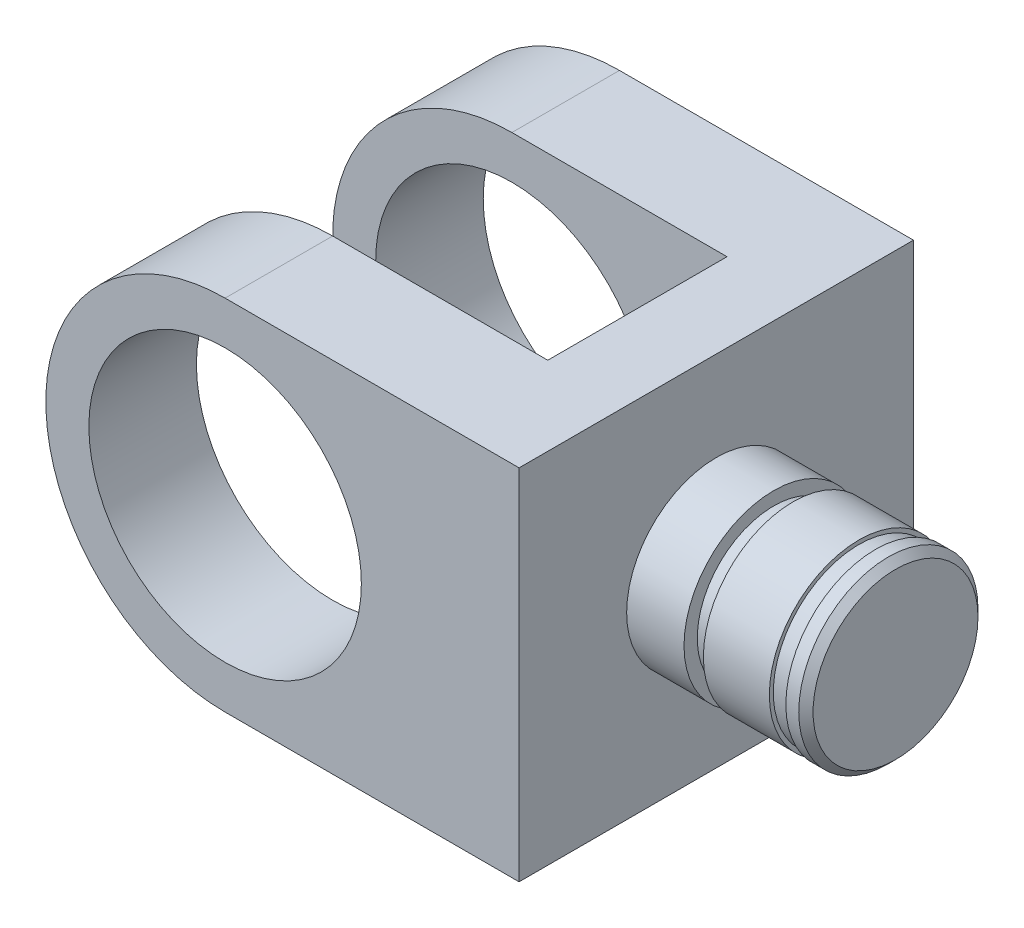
ISO-10303-21;
HEADER;
FILE_DESCRIPTION(('STEP AP214'),'2;1');
FILE_NAME('part.step','',(''),(''),'','','');
FILE_SCHEMA(('AUTOMOTIVE_DESIGN { 1 0 10303 214 1 1 1 1 }'));
ENDSEC;
DATA;
#1=APPLICATION_CONTEXT('core data for automotive mechanical design processes');
#2=APPLICATION_PROTOCOL_DEFINITION('international standard','automotive_design',2000,#1);
#3=PRODUCT_CONTEXT('',#1,'mechanical');
#4=PRODUCT('Part','Part','',(#3));
#5=PRODUCT_RELATED_PRODUCT_CATEGORY('part','',(#4));
#6=PRODUCT_DEFINITION_FORMATION('','',#4);
#7=PRODUCT_DEFINITION_CONTEXT('part definition',#1,'design');
#8=PRODUCT_DEFINITION('design','',#6,#7);
#9=PRODUCT_DEFINITION_SHAPE('','',#8);
#10=(LENGTH_UNIT() NAMED_UNIT(*) SI_UNIT(.MILLI.,.METRE.));
#11=(NAMED_UNIT(*) PLANE_ANGLE_UNIT() SI_UNIT($,.RADIAN.));
#12=(NAMED_UNIT(*) SI_UNIT($,.STERADIAN.) SOLID_ANGLE_UNIT());
#13=UNCERTAINTY_MEASURE_WITH_UNIT(LENGTH_MEASURE(1.E-05),#10,'distance_accuracy_value','');
#14=(GEOMETRIC_REPRESENTATION_CONTEXT(3) GLOBAL_UNCERTAINTY_ASSIGNED_CONTEXT((#13)) GLOBAL_UNIT_ASSIGNED_CONTEXT((#10,
#11,#12)) REPRESENTATION_CONTEXT('',''));
#15=CARTESIAN_POINT('',(0.,0.,0.));
#16=DIRECTION('',(0.,0.,1.));
#17=DIRECTION('',(1.,0.,0.));
#18=AXIS2_PLACEMENT_3D('',#15,#16,#17);
#19=CARTESIAN_POINT('',(-56.3524439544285,35.3069949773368,27.5));
#20=DIRECTION('',(0.,-1.,0.));
#21=DIRECTION('',(0.,0.,-1.));
#22=AXIS2_PLACEMENT_3D('',#19,#20,#21);
#23=PLANE('',#22);
#24=DIRECTION('',(-1.,0.,0.));
#25=VECTOR('',#24,1.);
#26=CARTESIAN_POINT('',(-56.3524439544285,35.3069949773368,-12.5));
#27=LINE('',#26,#25);
#28=CARTESIAN_POINT('',(-26.3524439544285,35.3069949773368,-12.5));
#29=VERTEX_POINT('',#28);
#30=CARTESIAN_POINT('',(-56.3524439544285,35.3069949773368,-12.5));
#31=VERTEX_POINT('',#30);
#32=EDGE_CURVE('E121',#29,#31,#27,.T.);
#33=ORIENTED_EDGE('',*,*,#32,.F.);
#34=DIRECTION('',(0.,0.,1.));
#35=VECTOR('',#34,1.);
#36=CARTESIAN_POINT('',(-26.3524439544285,35.3069949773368,27.5));
#37=LINE('',#36,#35);
#38=CARTESIAN_POINT('',(-26.3524439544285,35.3069949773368,12.5));
#39=VERTEX_POINT('',#38);
#40=EDGE_CURVE('E114',#29,#39,#37,.T.);
#41=ORIENTED_EDGE('',*,*,#40,.T.);
#42=DIRECTION('',(-1.,0.,0.));
#43=VECTOR('',#42,1.);
#44=CARTESIAN_POINT('',(-56.3524439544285,35.3069949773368,12.5));
#45=LINE('',#44,#43);
#46=CARTESIAN_POINT('',(-56.3524439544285,35.3069949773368,12.5));
#47=VERTEX_POINT('',#46);
#48=EDGE_CURVE('E103',#39,#47,#45,.T.);
#49=ORIENTED_EDGE('',*,*,#48,.T.);
#50=DIRECTION('',(0.,0.,-1.));
#51=VECTOR('',#50,1.);
#52=CARTESIAN_POINT('',(-56.3524439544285,35.3069949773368,27.5));
#53=LINE('',#52,#51);
#54=CARTESIAN_POINT('',(-56.3524439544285,35.3069949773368,27.5));
#55=VERTEX_POINT('',#54);
#56=EDGE_CURVE('E156',#55,#47,#53,.T.);
#57=ORIENTED_EDGE('',*,*,#56,.F.);
#58=DIRECTION('',(-1.,0.,0.));
#59=VECTOR('',#58,1.);
#60=CARTESIAN_POINT('',(-56.3524439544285,35.3069949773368,27.5));
#61=LINE('',#60,#59);
#62=CARTESIAN_POINT('',(-15.3524439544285,35.3069949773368,27.5));
#63=VERTEX_POINT('',#62);
#64=EDGE_CURVE('E83',#63,#55,#61,.T.);
#65=ORIENTED_EDGE('',*,*,#64,.F.);
#66=DIRECTION('',(0.,0.,-1.));
#67=VECTOR('',#66,1.);
#68=CARTESIAN_POINT('',(-15.3524439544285,35.3069949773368,27.5));
#69=LINE('',#68,#67);
#70=CARTESIAN_POINT('',(-15.3524439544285,35.3069949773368,-27.5));
#71=VERTEX_POINT('',#70);
#72=EDGE_CURVE('E158',#63,#71,#69,.T.);
#73=ORIENTED_EDGE('',*,*,#72,.T.);
#74=DIRECTION('',(-1.,0.,0.));
#75=VECTOR('',#74,1.);
#76=CARTESIAN_POINT('',(-56.3524439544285,35.3069949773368,-27.5));
#77=LINE('',#76,#75);
#78=CARTESIAN_POINT('',(-56.3524439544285,35.3069949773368,-27.5));
#79=VERTEX_POINT('',#78);
#80=EDGE_CURVE('E143',#71,#79,#77,.T.);
#81=ORIENTED_EDGE('',*,*,#80,.T.);
#82=EDGE_CURVE('E155',#31,#79,#53,.T.);
#83=ORIENTED_EDGE('',*,*,#82,.F.);
#84=EDGE_LOOP('',(#33,#41,#49,#57,#65,#73,#81,#83));
#85=FACE_BOUND('',#84,.T.);
#86=ADVANCED_FACE('F31',(#85),#23,.F.);
#87=CARTESIAN_POINT('',(-56.3524439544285,10.3069949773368,27.5));
#88=DIRECTION('',(0.,0.,-1.));
#89=DIRECTION('',(-1.,0.,0.));
#90=AXIS2_PLACEMENT_3D('',#87,#88,#89);
#91=CYLINDRICAL_SURFACE('',#90,25.);
#92=CARTESIAN_POINT('',(-56.3524439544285,10.3069949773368,-12.5));
#93=DIRECTION('',(0.,0.,1.));
#94=DIRECTION('',(1.,0.,0.));
#95=AXIS2_PLACEMENT_3D('',#92,#93,#94);
#96=CIRCLE('',#95,25.);
#97=CARTESIAN_POINT('',(-56.3524439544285,-14.6930050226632,-12.5));
#98=VERTEX_POINT('',#97);
#99=EDGE_CURVE('E127',#31,#98,#96,.T.);
#100=ORIENTED_EDGE('',*,*,#99,.F.);
#101=ORIENTED_EDGE('',*,*,#82,.T.);
#102=CARTESIAN_POINT('',(-56.3524439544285,10.3069949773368,-27.5));
#103=DIRECTION('',(0.,0.,1.));
#104=DIRECTION('',(1.,0.,0.));
#105=AXIS2_PLACEMENT_3D('',#102,#103,#104);
#106=CIRCLE('',#105,25.);
#107=CARTESIAN_POINT('',(-56.3524439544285,-14.6930050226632,-27.5));
#108=VERTEX_POINT('',#107);
#109=EDGE_CURVE('E146',#79,#108,#106,.T.);
#110=ORIENTED_EDGE('',*,*,#109,.T.);
#111=DIRECTION('',(0.,0.,-1.));
#112=VECTOR('',#111,1.);
#113=CARTESIAN_POINT('',(-56.3524439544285,-14.6930050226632,27.5));
#114=LINE('',#113,#112);
#115=EDGE_CURVE('E151',#98,#108,#114,.T.);
#116=ORIENTED_EDGE('',*,*,#115,.F.);
#117=EDGE_LOOP('',(#100,#101,#110,#116));
#118=FACE_BOUND('',#117,.T.);
#119=ADVANCED_FACE('F225',(#118),#91,.T.);
#120=CARTESIAN_POINT('',(-56.3524439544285,-14.6930050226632,27.5));
#121=DIRECTION('',(0.,1.,0.));
#122=DIRECTION('',(-1.,0.,0.));
#123=AXIS2_PLACEMENT_3D('',#120,#121,#122);
#124=PLANE('',#123);
#125=DIRECTION('',(1.,0.,0.));
#126=VECTOR('',#125,1.);
#127=CARTESIAN_POINT('',(-56.3524439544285,-14.6930050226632,-12.5));
#128=LINE('',#127,#126);
#129=CARTESIAN_POINT('',(-26.3524439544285,-14.6930050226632,-12.5));
#130=VERTEX_POINT('',#129);
#131=EDGE_CURVE('E196',#98,#130,#128,.T.);
#132=ORIENTED_EDGE('',*,*,#131,.F.);
#133=ORIENTED_EDGE('',*,*,#115,.T.);
#134=DIRECTION('',(1.,0.,0.));
#135=VECTOR('',#134,1.);
#136=CARTESIAN_POINT('',(-56.3524439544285,-14.6930050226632,-27.5));
#137=LINE('',#136,#135);
#138=CARTESIAN_POINT('',(-15.3524439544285,-14.6930050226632,-27.5));
#139=VERTEX_POINT('',#138);
#140=EDGE_CURVE('E75',#108,#139,#137,.T.);
#141=ORIENTED_EDGE('',*,*,#140,.T.);
#142=DIRECTION('',(0.,0.,-1.));
#143=VECTOR('',#142,1.);
#144=CARTESIAN_POINT('',(-15.3524439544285,-14.6930050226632,27.5));
#145=LINE('',#144,#143);
#146=CARTESIAN_POINT('',(-15.3524439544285,-14.6930050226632,27.5));
#147=VERTEX_POINT('',#146);
#148=EDGE_CURVE('E140',#147,#139,#145,.T.);
#149=ORIENTED_EDGE('',*,*,#148,.F.);
#150=DIRECTION('',(1.,0.,0.));
#151=VECTOR('',#150,1.);
#152=CARTESIAN_POINT('',(-56.3524439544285,-14.6930050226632,27.5));
#153=LINE('',#152,#151);
#154=CARTESIAN_POINT('',(-56.3524439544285,-14.6930050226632,27.5));
#155=VERTEX_POINT('',#154);
#156=EDGE_CURVE('E55',#155,#147,#153,.T.);
#157=ORIENTED_EDGE('',*,*,#156,.F.);
#158=CARTESIAN_POINT('',(-56.3524439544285,-14.6930050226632,12.5));
#159=VERTEX_POINT('',#158);
#160=EDGE_CURVE('E152',#155,#159,#114,.T.);
#161=ORIENTED_EDGE('',*,*,#160,.T.);
#162=DIRECTION('',(1.,0.,0.));
#163=VECTOR('',#162,1.);
#164=CARTESIAN_POINT('',(-56.3524439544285,-14.6930050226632,12.5));
#165=LINE('',#164,#163);
#166=CARTESIAN_POINT('',(-26.3524439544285,-14.6930050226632,12.5));
#167=VERTEX_POINT('',#166);
#168=EDGE_CURVE('E194',#159,#167,#165,.T.);
#169=ORIENTED_EDGE('',*,*,#168,.T.);
#170=DIRECTION('',(0.,0.,-1.));
#171=VECTOR('',#170,1.);
#172=CARTESIAN_POINT('',(-26.3524439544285,-14.6930050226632,27.5));
#173=LINE('',#172,#171);
#174=EDGE_CURVE('E11',#167,#130,#173,.T.);
#175=ORIENTED_EDGE('',*,*,#174,.T.);
#176=EDGE_LOOP('',(#132,#133,#141,#149,#157,#161,#169,#175));
#177=FACE_BOUND('',#176,.T.);
#178=ADVANCED_FACE('F207',(#177),#124,.F.);
#179=CARTESIAN_POINT('',(-56.3524439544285,10.3069949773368,27.5));
#180=DIRECTION('',(0.,0.,-1.));
#181=DIRECTION('',(-1.,0.,0.));
#182=AXIS2_PLACEMENT_3D('',#179,#180,#181);
#183=CYLINDRICAL_SURFACE('',#182,19.);
#184=CARTESIAN_POINT('',(-56.3524439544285,10.3069949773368,-27.5));
#185=DIRECTION('',(0.,0.,1.));
#186=DIRECTION('',(1.,0.,0.));
#187=AXIS2_PLACEMENT_3D('',#184,#185,#186);
#188=CIRCLE('',#187,19.);
#189=CARTESIAN_POINT('',(-37.3524439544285,10.3069949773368,-27.5));
#190=VERTEX_POINT('',#189);
#191=EDGE_CURVE('E122',#190,#190,#188,.T.);
#192=ORIENTED_EDGE('',*,*,#191,.F.);
#193=EDGE_LOOP('',(#192));
#194=FACE_BOUND('',#193,.T.);
#195=CARTESIAN_POINT('',(-56.3524439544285,10.3069949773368,-12.5));
#196=DIRECTION('',(0.,0.,1.));
#197=DIRECTION('',(1.,0.,0.));
#198=AXIS2_PLACEMENT_3D('',#195,#196,#197);
#199=CIRCLE('',#198,19.);
#200=CARTESIAN_POINT('',(-37.3524439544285,10.3069949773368,-12.5));
#201=VERTEX_POINT('',#200);
#202=EDGE_CURVE('E109',#201,#201,#199,.T.);
#203=ORIENTED_EDGE('',*,*,#202,.T.);
#204=EDGE_LOOP('',(#203));
#205=FACE_BOUND('',#204,.T.);
#206=ADVANCED_FACE('F232',(#194,#205),#183,.F.);
#207=CARTESIAN_POINT('',(9.64755604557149,10.3069949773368,0.));
#208=DIRECTION('',(1.,0.,0.));
#209=DIRECTION('',(0.,0.,-1.));
#210=AXIS2_PLACEMENT_3D('',#207,#208,#209);
#211=PLANE('',#210);
#212=CARTESIAN_POINT('',(9.64755604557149,10.3069949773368,0.));
#213=DIRECTION('',(1.,0.,0.));
#214=DIRECTION('',(0.,0.,-1.));
#215=AXIS2_PLACEMENT_3D('',#212,#213,#214);
#216=CIRCLE('',#215,11.5);
#217=CARTESIAN_POINT('',(9.64755604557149,10.3069949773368,-11.5));
#218=VERTEX_POINT('',#217);
#219=EDGE_CURVE('E39',#218,#218,#216,.T.);
#220=ORIENTED_EDGE('',*,*,#219,.T.);
#221=EDGE_LOOP('',(#220));
#222=FACE_BOUND('',#221,.T.);
#223=ADVANCED_FACE('F33',(#222),#211,.T.);
#224=CARTESIAN_POINT('',(9.64755604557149,10.3069949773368,0.));
#225=DIRECTION('',(-1.,0.,0.));
#226=DIRECTION('',(0.,0.,1.));
#227=AXIS2_PLACEMENT_3D('',#224,#225,#226);
#228=CONICAL_SURFACE('',#227,11.5,0.785398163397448);
#229=CARTESIAN_POINT('',(8.64755604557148,10.3069949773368,0.));
#230=DIRECTION('',(1.,0.,0.));
#231=DIRECTION('',(0.,0.,-1.));
#232=AXIS2_PLACEMENT_3D('',#229,#230,#231);
#233=CIRCLE('',#232,12.5);
#234=CARTESIAN_POINT('',(8.64755604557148,10.3069949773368,-12.5));
#235=VERTEX_POINT('',#234);
#236=EDGE_CURVE('E187',#235,#235,#233,.T.);
#237=ORIENTED_EDGE('',*,*,#236,.T.);
#238=EDGE_LOOP('',(#237));
#239=FACE_BOUND('',#238,.T.);
#240=ORIENTED_EDGE('',*,*,#219,.F.);
#241=EDGE_LOOP('',(#240));
#242=FACE_BOUND('',#241,.T.);
#243=ADVANCED_FACE('F285',(#239,#242),#228,.T.);
#244=CARTESIAN_POINT('',(21.1095185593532,10.3069949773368,0.));
#245=DIRECTION('',(1.,0.,0.));
#246=DIRECTION('',(0.,0.,-1.));
#247=AXIS2_PLACEMENT_3D('',#244,#245,#246);
#248=CYLINDRICAL_SURFACE('',#247,12.5);
#249=CARTESIAN_POINT('',(6.84755604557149,10.3069949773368,0.));
#250=DIRECTION('',(1.,0.,0.));
#251=DIRECTION('',(0.,0.,-1.));
#252=AXIS2_PLACEMENT_3D('',#249,#250,#251);
#253=CIRCLE('',#252,12.5);
#254=CARTESIAN_POINT('',(6.84755604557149,10.3069949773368,-12.5));
#255=VERTEX_POINT('',#254);
#256=EDGE_CURVE('E184',#255,#255,#253,.T.);
#257=ORIENTED_EDGE('',*,*,#256,.T.);
#258=EDGE_LOOP('',(#257));
#259=FACE_BOUND('',#258,.T.);
#260=ORIENTED_EDGE('',*,*,#236,.F.);
#261=EDGE_LOOP('',(#260));
#262=FACE_BOUND('',#261,.T.);
#263=ADVANCED_FACE('F282',(#259,#262),#248,.T.);
#264=CARTESIAN_POINT('',(6.84755604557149,22.8069949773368,0.));
#265=DIRECTION('',(-1.,0.,0.));
#266=DIRECTION('',(0.,0.,1.));
#267=AXIS2_PLACEMENT_3D('',#264,#265,#266);
#268=PLANE('',#267);
#269=CARTESIAN_POINT('',(6.84755604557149,10.3069949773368,0.));
#270=DIRECTION('',(1.,0.,0.));
#271=DIRECTION('',(0.,0.,-1.));
#272=AXIS2_PLACEMENT_3D('',#269,#270,#271);
#273=CIRCLE('',#272,11.95);
#274=CARTESIAN_POINT('',(6.84755604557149,10.3069949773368,-11.95));
#275=VERTEX_POINT('',#274);
#276=EDGE_CURVE('E181',#275,#275,#273,.T.);
#277=ORIENTED_EDGE('',*,*,#276,.T.);
#278=EDGE_LOOP('',(#277));
#279=FACE_BOUND('',#278,.T.);
#280=ORIENTED_EDGE('',*,*,#256,.F.);
#281=EDGE_LOOP('',(#280));
#282=FACE_BOUND('',#281,.T.);
#283=ADVANCED_FACE('F278',(#279,#282),#268,.T.);
#284=CARTESIAN_POINT('',(21.1095185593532,10.3069949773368,0.));
#285=DIRECTION('',(1.,0.,0.));
#286=DIRECTION('',(0.,0.,-1.));
#287=AXIS2_PLACEMENT_3D('',#284,#285,#286);
#288=CYLINDRICAL_SURFACE('',#287,11.95);
#289=CARTESIAN_POINT('',(4.54755604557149,10.3069949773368,0.));
#290=DIRECTION('',(1.,0.,0.));
#291=DIRECTION('',(0.,0.,-1.));
#292=AXIS2_PLACEMENT_3D('',#289,#290,#291);
#293=CIRCLE('',#292,11.95);
#294=CARTESIAN_POINT('',(4.54755604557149,10.3069949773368,-11.95));
#295=VERTEX_POINT('',#294);
#296=EDGE_CURVE('E178',#295,#295,#293,.T.);
#297=ORIENTED_EDGE('',*,*,#296,.T.);
#298=EDGE_LOOP('',(#297));
#299=FACE_BOUND('',#298,.T.);
#300=ORIENTED_EDGE('',*,*,#276,.F.);
#301=EDGE_LOOP('',(#300));
#302=FACE_BOUND('',#301,.T.);
#303=ADVANCED_FACE('F274',(#299,#302),#288,.T.);
#304=CARTESIAN_POINT('',(4.54755604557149,22.8069949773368,0.));
#305=DIRECTION('',(1.,0.,0.));
#306=DIRECTION('',(0.,0.,-1.));
#307=AXIS2_PLACEMENT_3D('',#304,#305,#306);
#308=PLANE('',#307);
#309=CARTESIAN_POINT('',(4.54755604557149,10.3069949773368,0.));
#310=DIRECTION('',(1.,0.,0.));
#311=DIRECTION('',(0.,0.,-1.));
#312=AXIS2_PLACEMENT_3D('',#309,#310,#311);
#313=CIRCLE('',#312,12.5);
#314=CARTESIAN_POINT('',(4.54755604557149,10.3069949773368,-12.5));
#315=VERTEX_POINT('',#314);
#316=EDGE_CURVE('E175',#315,#315,#313,.T.);
#317=ORIENTED_EDGE('',*,*,#316,.T.);
#318=EDGE_LOOP('',(#317));
#319=FACE_BOUND('',#318,.T.);
#320=ORIENTED_EDGE('',*,*,#296,.F.);
#321=EDGE_LOOP('',(#320));
#322=FACE_BOUND('',#321,.T.);
#323=ADVANCED_FACE('F270',(#319,#322),#308,.T.);
#324=CARTESIAN_POINT('',(21.1095185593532,10.3069949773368,0.));
#325=DIRECTION('',(1.,0.,0.));
#326=DIRECTION('',(0.,0.,-1.));
#327=AXIS2_PLACEMENT_3D('',#324,#325,#326);
#328=CYLINDRICAL_SURFACE('',#327,12.5);
#329=CARTESIAN_POINT('',(-4.65244395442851,10.3069949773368,0.));
#330=DIRECTION('',(1.,0.,0.));
#331=DIRECTION('',(0.,0.,-1.));
#332=AXIS2_PLACEMENT_3D('',#329,#330,#331);
#333=CIRCLE('',#332,12.5);
#334=CARTESIAN_POINT('',(-4.65244395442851,10.3069949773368,-12.5));
#335=VERTEX_POINT('',#334);
#336=EDGE_CURVE('E172',#335,#335,#333,.T.);
#337=ORIENTED_EDGE('',*,*,#336,.T.);
#338=EDGE_LOOP('',(#337));
#339=FACE_BOUND('',#338,.T.);
#340=ORIENTED_EDGE('',*,*,#316,.F.);
#341=EDGE_LOOP('',(#340));
#342=FACE_BOUND('',#341,.T.);
#343=ADVANCED_FACE('F266',(#339,#342),#328,.T.);
#344=CARTESIAN_POINT('',(-4.65244395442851,22.8069949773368,0.));
#345=DIRECTION('',(-1.,0.,0.));
#346=DIRECTION('',(0.,0.,1.));
#347=AXIS2_PLACEMENT_3D('',#344,#345,#346);
#348=PLANE('',#347);
#349=CARTESIAN_POINT('',(-4.65244395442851,10.3069949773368,0.));
#350=DIRECTION('',(1.,0.,0.));
#351=DIRECTION('',(0.,0.,-1.));
#352=AXIS2_PLACEMENT_3D('',#349,#350,#351);
#353=CIRCLE('',#352,10.65);
#354=CARTESIAN_POINT('',(-4.65244395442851,10.3069949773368,-10.65));
#355=VERTEX_POINT('',#354);
#356=EDGE_CURVE('E169',#355,#355,#353,.T.);
#357=ORIENTED_EDGE('',*,*,#356,.T.);
#358=EDGE_LOOP('',(#357));
#359=FACE_BOUND('',#358,.T.);
#360=ORIENTED_EDGE('',*,*,#336,.F.);
#361=EDGE_LOOP('',(#360));
#362=FACE_BOUND('',#361,.T.);
#363=ADVANCED_FACE('F262',(#359,#362),#348,.T.);
#364=CARTESIAN_POINT('',(21.1095185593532,10.3069949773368,0.));
#365=DIRECTION('',(1.,0.,0.));
#366=DIRECTION('',(0.,0.,-1.));
#367=AXIS2_PLACEMENT_3D('',#364,#365,#366);
#368=CYLINDRICAL_SURFACE('',#367,10.65);
#369=CARTESIAN_POINT('',(-7.35244395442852,10.3069949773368,0.));
#370=DIRECTION('',(1.,0.,0.));
#371=DIRECTION('',(0.,0.,-1.));
#372=AXIS2_PLACEMENT_3D('',#369,#370,#371);
#373=CIRCLE('',#372,10.65);
#374=CARTESIAN_POINT('',(-7.35244395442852,10.3069949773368,-10.65));
#375=VERTEX_POINT('',#374);
#376=EDGE_CURVE('E166',#375,#375,#373,.T.);
#377=ORIENTED_EDGE('',*,*,#376,.T.);
#378=EDGE_LOOP('',(#377));
#379=FACE_BOUND('',#378,.T.);
#380=ORIENTED_EDGE('',*,*,#356,.F.);
#381=EDGE_LOOP('',(#380));
#382=FACE_BOUND('',#381,.T.);
#383=ADVANCED_FACE('F258',(#379,#382),#368,.T.);
#384=CARTESIAN_POINT('',(-7.35244395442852,22.8069949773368,0.));
#385=DIRECTION('',(1.,0.,0.));
#386=DIRECTION('',(0.,0.,-1.));
#387=AXIS2_PLACEMENT_3D('',#384,#385,#386);
#388=PLANE('',#387);
#389=CARTESIAN_POINT('',(-7.35244395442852,10.3069949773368,0.));
#390=DIRECTION('',(1.,0.,0.));
#391=DIRECTION('',(0.,0.,-1.));
#392=AXIS2_PLACEMENT_3D('',#389,#390,#391);
#393=CIRCLE('',#392,12.5);
#394=CARTESIAN_POINT('',(-7.35244395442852,10.3069949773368,-12.5));
#395=VERTEX_POINT('',#394);
#396=EDGE_CURVE('E163',#395,#395,#393,.T.);
#397=ORIENTED_EDGE('',*,*,#396,.T.);
#398=EDGE_LOOP('',(#397));
#399=FACE_BOUND('',#398,.T.);
#400=ORIENTED_EDGE('',*,*,#376,.F.);
#401=EDGE_LOOP('',(#400));
#402=FACE_BOUND('',#401,.T.);
#403=ADVANCED_FACE('F254',(#399,#402),#388,.T.);
#404=CARTESIAN_POINT('',(21.1095185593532,10.3069949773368,0.));
#405=DIRECTION('',(1.,0.,0.));
#406=DIRECTION('',(0.,0.,-1.));
#407=AXIS2_PLACEMENT_3D('',#404,#405,#406);
#408=CYLINDRICAL_SURFACE('',#407,12.5);
#409=CARTESIAN_POINT('',(-15.3524439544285,10.3069949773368,0.));
#410=DIRECTION('',(-1.,0.,0.));
#411=DIRECTION('',(0.,-1.,0.));
#412=AXIS2_PLACEMENT_3D('',#409,#410,#411);
#413=CIRCLE('',#412,12.5);
#414=CARTESIAN_POINT('',(-15.3524439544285,-2.19300502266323,0.));
#415=VERTEX_POINT('',#414);
#416=EDGE_CURVE('E160',#415,#415,#413,.F.);
#417=ORIENTED_EDGE('',*,*,#416,.T.);
#418=EDGE_LOOP('',(#417));
#419=FACE_BOUND('',#418,.T.);
#420=ORIENTED_EDGE('',*,*,#396,.F.);
#421=EDGE_LOOP('',(#420));
#422=FACE_BOUND('',#421,.T.);
#423=ADVANCED_FACE('F251',(#419,#422),#408,.T.);
#424=CARTESIAN_POINT('',(-56.3524439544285,10.3069949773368,27.5));
#425=DIRECTION('',(0.,0.,1.));
#426=DIRECTION('',(1.,0.,0.));
#427=AXIS2_PLACEMENT_3D('',#424,#425,#426);
#428=PLANE('',#427);
#429=DIRECTION('',(0.,1.,0.));
#430=VECTOR('',#429,1.);
#431=CARTESIAN_POINT('',(-15.3524439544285,35.3069949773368,27.5));
#432=LINE('',#431,#430);
#433=EDGE_CURVE('E134',#147,#63,#432,.T.);
#434=ORIENTED_EDGE('',*,*,#433,.T.);
#435=ORIENTED_EDGE('',*,*,#64,.T.);
#436=CARTESIAN_POINT('',(-56.3524439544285,10.3069949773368,27.5));
#437=DIRECTION('',(0.,0.,1.));
#438=DIRECTION('',(1.,0.,0.));
#439=AXIS2_PLACEMENT_3D('',#436,#437,#438);
#440=CIRCLE('',#439,25.);
#441=EDGE_CURVE('E137',#55,#155,#440,.T.);
#442=ORIENTED_EDGE('',*,*,#441,.T.);
#443=ORIENTED_EDGE('',*,*,#156,.T.);
#444=EDGE_LOOP('',(#434,#435,#442,#443));
#445=FACE_BOUND('',#444,.T.);
#446=CARTESIAN_POINT('',(-56.3524439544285,10.3069949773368,27.5));
#447=DIRECTION('',(0.,0.,1.));
#448=DIRECTION('',(1.,0.,0.));
#449=AXIS2_PLACEMENT_3D('',#446,#447,#448);
#450=CIRCLE('',#449,19.);
#451=CARTESIAN_POINT('',(-37.3524439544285,10.3069949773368,27.5));
#452=VERTEX_POINT('',#451);
#453=EDGE_CURVE('E125',#452,#452,#450,.T.);
#454=ORIENTED_EDGE('',*,*,#453,.F.);
#455=EDGE_LOOP('',(#454));
#456=FACE_BOUND('',#455,.T.);
#457=ADVANCED_FACE('F213',(#445,#456),#428,.T.);
#458=CARTESIAN_POINT('',(-56.3524439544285,10.3069949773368,-27.5));
#459=DIRECTION('',(0.,0.,1.));
#460=DIRECTION('',(1.,0.,0.));
#461=AXIS2_PLACEMENT_3D('',#458,#459,#460);
#462=PLANE('',#461);
#463=DIRECTION('',(0.,1.,0.));
#464=VECTOR('',#463,1.);
#465=CARTESIAN_POINT('',(-15.3524439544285,35.3069949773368,-27.5));
#466=LINE('',#465,#464);
#467=EDGE_CURVE('E132',#139,#71,#466,.T.);
#468=ORIENTED_EDGE('',*,*,#467,.F.);
#469=ORIENTED_EDGE('',*,*,#140,.F.);
#470=ORIENTED_EDGE('',*,*,#109,.F.);
#471=ORIENTED_EDGE('',*,*,#80,.F.);
#472=EDGE_LOOP('',(#468,#469,#470,#471));
#473=FACE_BOUND('',#472,.T.);
#474=ORIENTED_EDGE('',*,*,#191,.T.);
#475=EDGE_LOOP('',(#474));
#476=FACE_BOUND('',#475,.T.);
#477=ADVANCED_FACE('F222',(#473,#476),#462,.F.);
#478=CARTESIAN_POINT('',(-15.3524439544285,35.3069949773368,27.5));
#479=DIRECTION('',(-1.,0.,0.));
#480=DIRECTION('',(0.,-1.,0.));
#481=AXIS2_PLACEMENT_3D('',#478,#479,#480);
#482=PLANE('',#481);
#483=ORIENTED_EDGE('',*,*,#416,.F.);
#484=EDGE_LOOP('',(#483));
#485=FACE_BOUND('',#484,.T.);
#486=ORIENTED_EDGE('',*,*,#467,.T.);
#487=ORIENTED_EDGE('',*,*,#72,.F.);
#488=ORIENTED_EDGE('',*,*,#433,.F.);
#489=ORIENTED_EDGE('',*,*,#148,.T.);
#490=EDGE_LOOP('',(#486,#487,#488,#489));
#491=FACE_BOUND('',#490,.T.);
#492=ADVANCED_FACE('F218',(#485,#491),#482,.F.);
#493=ORIENTED_EDGE('',*,*,#56,.T.);
#494=CARTESIAN_POINT('',(-56.3524439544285,10.3069949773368,12.5));
#495=DIRECTION('',(0.,0.,1.));
#496=DIRECTION('',(1.,0.,0.));
#497=AXIS2_PLACEMENT_3D('',#494,#495,#496);
#498=CIRCLE('',#497,25.);
#499=EDGE_CURVE('E106',#47,#159,#498,.T.);
#500=ORIENTED_EDGE('',*,*,#499,.T.);
#501=ORIENTED_EDGE('',*,*,#160,.F.);
#502=ORIENTED_EDGE('',*,*,#441,.F.);
#503=EDGE_LOOP('',(#493,#500,#501,#502));
#504=FACE_BOUND('',#503,.T.);
#505=ADVANCED_FACE('F211',(#504),#91,.T.);
#506=CARTESIAN_POINT('',(-56.3524439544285,10.3069949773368,12.5));
#507=DIRECTION('',(0.,0.,1.));
#508=DIRECTION('',(1.,0.,0.));
#509=AXIS2_PLACEMENT_3D('',#506,#507,#508);
#510=CIRCLE('',#509,19.);
#511=CARTESIAN_POINT('',(-37.3524439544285,10.3069949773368,12.5));
#512=VERTEX_POINT('',#511);
#513=EDGE_CURVE('E192',#512,#512,#510,.T.);
#514=ORIENTED_EDGE('',*,*,#513,.F.);
#515=EDGE_LOOP('',(#514));
#516=FACE_BOUND('',#515,.T.);
#517=ORIENTED_EDGE('',*,*,#453,.T.);
#518=EDGE_LOOP('',(#517));
#519=FACE_BOUND('',#518,.T.);
#520=ADVANCED_FACE('F236',(#516,#519),#183,.F.);
#521=CARTESIAN_POINT('',(-26.3524439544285,42.202131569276,-12.5));
#522=DIRECTION('',(1.,0.,0.));
#523=DIRECTION('',(0.,1.,0.));
#524=AXIS2_PLACEMENT_3D('',#521,#522,#523);
#525=PLANE('',#524);
#526=DIRECTION('',(0.,1.,0.));
#527=VECTOR('',#526,1.);
#528=CARTESIAN_POINT('',(-26.3524439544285,42.202131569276,-12.5));
#529=LINE('',#528,#527);
#530=EDGE_CURVE('E117',#130,#29,#529,.T.);
#531=ORIENTED_EDGE('',*,*,#530,.F.);
#532=ORIENTED_EDGE('',*,*,#174,.F.);
#533=DIRECTION('',(0.,1.,0.));
#534=VECTOR('',#533,1.);
#535=CARTESIAN_POINT('',(-26.3524439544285,42.202131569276,12.5));
#536=LINE('',#535,#534);
#537=EDGE_CURVE('E46',#167,#39,#536,.T.);
#538=ORIENTED_EDGE('',*,*,#537,.T.);
#539=ORIENTED_EDGE('',*,*,#40,.F.);
#540=EDGE_LOOP('',(#531,#532,#538,#539));
#541=FACE_BOUND('',#540,.T.);
#542=ADVANCED_FACE('F113',(#541),#525,.F.);
#543=CARTESIAN_POINT('',(-84.4932010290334,-26.3216954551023,-12.5));
#544=DIRECTION('',(0.,0.,1.));
#545=DIRECTION('',(1.,0.,0.));
#546=AXIS2_PLACEMENT_3D('',#543,#544,#545);
#547=PLANE('',#546);
#548=ORIENTED_EDGE('',*,*,#202,.F.);
#549=EDGE_LOOP('',(#548));
#550=FACE_BOUND('',#549,.T.);
#551=ORIENTED_EDGE('',*,*,#32,.T.);
#552=ORIENTED_EDGE('',*,*,#99,.T.);
#553=ORIENTED_EDGE('',*,*,#131,.T.);
#554=ORIENTED_EDGE('',*,*,#530,.T.);
#555=EDGE_LOOP('',(#551,#552,#553,#554));
#556=FACE_BOUND('',#555,.T.);
#557=ADVANCED_FACE('F205',(#550,#556),#547,.T.);
#558=CARTESIAN_POINT('',(-84.4932010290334,-26.3216954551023,12.5));
#559=DIRECTION('',(0.,0.,1.));
#560=DIRECTION('',(1.,0.,0.));
#561=AXIS2_PLACEMENT_3D('',#558,#559,#560);
#562=PLANE('',#561);
#563=ORIENTED_EDGE('',*,*,#513,.T.);
#564=EDGE_LOOP('',(#563));
#565=FACE_BOUND('',#564,.T.);
#566=ORIENTED_EDGE('',*,*,#537,.F.);
#567=ORIENTED_EDGE('',*,*,#168,.F.);
#568=ORIENTED_EDGE('',*,*,#499,.F.);
#569=ORIENTED_EDGE('',*,*,#48,.F.);
#570=EDGE_LOOP('',(#566,#567,#568,#569));
#571=FACE_BOUND('',#570,.T.);
#572=ADVANCED_FACE('F104',(#565,#571),#562,.F.);
#573=CLOSED_SHELL('',(#86,#119,#178,#206,#223,#243,#263,#283,#303,#323,#343,#363,#383,#403,#423,
#457,#477,#492,#505,#520,#542,#557,#572));
#574=MANIFOLD_SOLID_BREP('B2',#573);
#575=ADVANCED_BREP_SHAPE_REPRESENTATION('',(#18,#574),#14);
#576=SHAPE_DEFINITION_REPRESENTATION(#9,#575);
ENDSEC;
END-ISO-10303-21;
